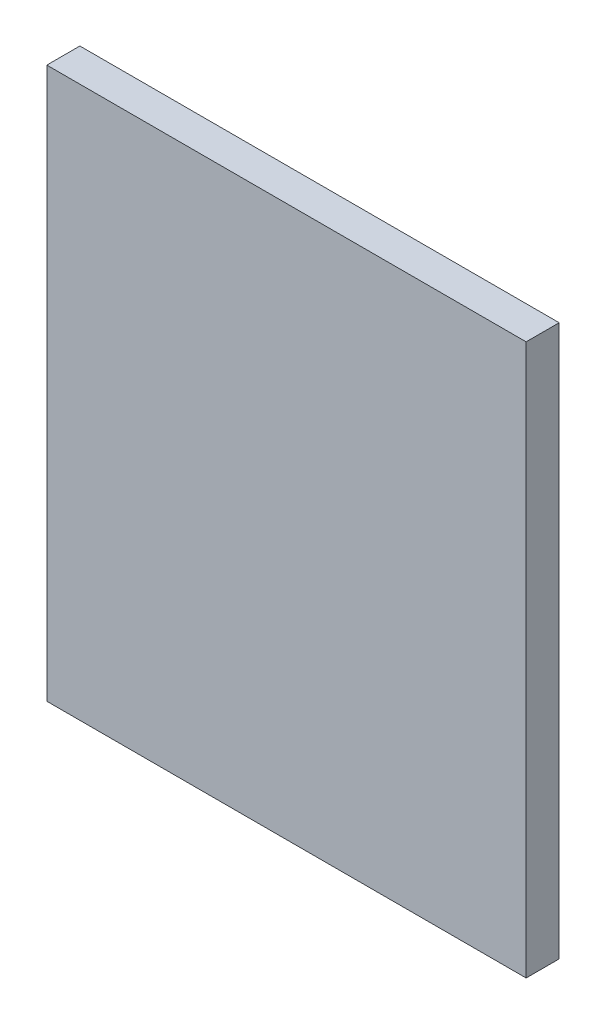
ISO-10303-21;
HEADER;
FILE_DESCRIPTION(('STEP AP214'),'2;1');
FILE_NAME('part.step','',(''),(''),'','','');
FILE_SCHEMA(('AUTOMOTIVE_DESIGN { 1 0 10303 214 1 1 1 1 }'));
ENDSEC;
DATA;
#1=APPLICATION_CONTEXT('core data for automotive mechanical design processes');
#2=APPLICATION_PROTOCOL_DEFINITION('international standard','automotive_design',2000,#1);
#3=PRODUCT_CONTEXT('',#1,'mechanical');
#4=PRODUCT('Part','Part','',(#3));
#5=PRODUCT_RELATED_PRODUCT_CATEGORY('part','',(#4));
#6=PRODUCT_DEFINITION_FORMATION('','',#4);
#7=PRODUCT_DEFINITION_CONTEXT('part definition',#1,'design');
#8=PRODUCT_DEFINITION('design','',#6,#7);
#9=PRODUCT_DEFINITION_SHAPE('','',#8);
#10=(LENGTH_UNIT() NAMED_UNIT(*) SI_UNIT(.MILLI.,.METRE.));
#11=(NAMED_UNIT(*) PLANE_ANGLE_UNIT() SI_UNIT($,.RADIAN.));
#12=(NAMED_UNIT(*) SI_UNIT($,.STERADIAN.) SOLID_ANGLE_UNIT());
#13=UNCERTAINTY_MEASURE_WITH_UNIT(LENGTH_MEASURE(1.E-05),#10,'distance_accuracy_value','');
#14=(GEOMETRIC_REPRESENTATION_CONTEXT(3) GLOBAL_UNCERTAINTY_ASSIGNED_CONTEXT((#13)) GLOBAL_UNIT_ASSIGNED_CONTEXT((#10,
#11,#12)) REPRESENTATION_CONTEXT('',''));
#15=CARTESIAN_POINT('',(0.,0.,0.));
#16=DIRECTION('',(0.,0.,1.));
#17=DIRECTION('',(1.,0.,0.));
#18=AXIS2_PLACEMENT_3D('',#15,#16,#17);
#19=CARTESIAN_POINT('',(0.,0.,12.));
#20=DIRECTION('',(0.,0.,1.));
#21=DIRECTION('',(1.,0.,0.));
#22=AXIS2_PLACEMENT_3D('',#19,#20,#21);
#23=PLANE('',#22);
#24=DIRECTION('',(1.,0.,0.));
#25=VECTOR('',#24,1.);
#26=CARTESIAN_POINT('',(-87.,-100.,12.));
#27=LINE('',#26,#25);
#28=CARTESIAN_POINT('',(-87.,-100.,12.));
#29=VERTEX_POINT('',#28);
#30=CARTESIAN_POINT('',(87.,-100.,12.));
#31=VERTEX_POINT('',#30);
#32=EDGE_CURVE('E81',#29,#31,#27,.T.);
#33=ORIENTED_EDGE('',*,*,#32,.T.);
#34=DIRECTION('',(0.,1.,0.));
#35=VECTOR('',#34,1.);
#36=CARTESIAN_POINT('',(87.,-100.,12.));
#37=LINE('',#36,#35);
#38=CARTESIAN_POINT('',(87.,100.,12.));
#39=VERTEX_POINT('',#38);
#40=EDGE_CURVE('E104',#31,#39,#37,.T.);
#41=ORIENTED_EDGE('',*,*,#40,.T.);
#42=DIRECTION('',(-1.,0.,0.));
#43=VECTOR('',#42,1.);
#44=CARTESIAN_POINT('',(87.,100.,12.));
#45=LINE('',#44,#43);
#46=CARTESIAN_POINT('',(-87.,100.,12.));
#47=VERTEX_POINT('',#46);
#48=EDGE_CURVE('E73',#39,#47,#45,.T.);
#49=ORIENTED_EDGE('',*,*,#48,.T.);
#50=DIRECTION('',(0.,-1.,0.));
#51=VECTOR('',#50,1.);
#52=CARTESIAN_POINT('',(-87.,100.,12.));
#53=LINE('',#52,#51);
#54=EDGE_CURVE('E10',#47,#29,#53,.T.);
#55=ORIENTED_EDGE('',*,*,#54,.T.);
#56=EDGE_LOOP('',(#33,#41,#49,#55));
#57=FACE_BOUND('',#56,.T.);
#58=ADVANCED_FACE('F16',(#57),#23,.T.);
#59=CARTESIAN_POINT('',(0.,0.,0.));
#60=DIRECTION('',(0.,0.,1.));
#61=DIRECTION('',(1.,0.,0.));
#62=AXIS2_PLACEMENT_3D('',#59,#60,#61);
#63=PLANE('',#62);
#64=DIRECTION('',(0.,-1.,0.));
#65=VECTOR('',#64,1.);
#66=CARTESIAN_POINT('',(-87.,100.,0.));
#67=LINE('',#66,#65);
#68=CARTESIAN_POINT('',(-87.,100.,0.));
#69=VERTEX_POINT('',#68);
#70=CARTESIAN_POINT('',(-87.,-100.,0.));
#71=VERTEX_POINT('',#70);
#72=EDGE_CURVE('E24',#69,#71,#67,.T.);
#73=ORIENTED_EDGE('',*,*,#72,.F.);
#74=DIRECTION('',(-1.,0.,0.));
#75=VECTOR('',#74,1.);
#76=CARTESIAN_POINT('',(87.,100.,0.));
#77=LINE('',#76,#75);
#78=CARTESIAN_POINT('',(87.,100.,0.));
#79=VERTEX_POINT('',#78);
#80=EDGE_CURVE('E108',#79,#69,#77,.T.);
#81=ORIENTED_EDGE('',*,*,#80,.F.);
#82=DIRECTION('',(0.,1.,0.));
#83=VECTOR('',#82,1.);
#84=CARTESIAN_POINT('',(87.,-100.,0.));
#85=LINE('',#84,#83);
#86=CARTESIAN_POINT('',(87.,-100.,0.));
#87=VERTEX_POINT('',#86);
#88=EDGE_CURVE('E83',#87,#79,#85,.T.);
#89=ORIENTED_EDGE('',*,*,#88,.F.);
#90=DIRECTION('',(1.,0.,0.));
#91=VECTOR('',#90,1.);
#92=CARTESIAN_POINT('',(-87.,-100.,0.));
#93=LINE('',#92,#91);
#94=EDGE_CURVE('E79',#71,#87,#93,.T.);
#95=ORIENTED_EDGE('',*,*,#94,.F.);
#96=EDGE_LOOP('',(#73,#81,#89,#95));
#97=FACE_BOUND('',#96,.T.);
#98=ADVANCED_FACE('F85',(#97),#63,.F.);
#99=CARTESIAN_POINT('',(-87.,100.,0.));
#100=DIRECTION('',(1.,0.,0.));
#101=DIRECTION('',(0.,1.,0.));
#102=AXIS2_PLACEMENT_3D('',#99,#100,#101);
#103=PLANE('',#102);
#104=ORIENTED_EDGE('',*,*,#72,.T.);
#105=DIRECTION('',(0.,0.,1.));
#106=VECTOR('',#105,1.);
#107=CARTESIAN_POINT('',(-87.,-100.,0.));
#108=LINE('',#107,#106);
#109=EDGE_CURVE('E67',#71,#29,#108,.T.);
#110=ORIENTED_EDGE('',*,*,#109,.T.);
#111=ORIENTED_EDGE('',*,*,#54,.F.);
#112=DIRECTION('',(0.,0.,1.));
#113=VECTOR('',#112,1.);
#114=CARTESIAN_POINT('',(-87.,100.,0.));
#115=LINE('',#114,#113);
#116=EDGE_CURVE('E70',#69,#47,#115,.T.);
#117=ORIENTED_EDGE('',*,*,#116,.F.);
#118=EDGE_LOOP('',(#104,#110,#111,#117));
#119=FACE_BOUND('',#118,.T.);
#120=ADVANCED_FACE('F66',(#119),#103,.F.);
#121=CARTESIAN_POINT('',(87.,100.,0.));
#122=DIRECTION('',(0.,-1.,0.));
#123=DIRECTION('',(0.,0.,-1.));
#124=AXIS2_PLACEMENT_3D('',#121,#122,#123);
#125=PLANE('',#124);
#126=ORIENTED_EDGE('',*,*,#80,.T.);
#127=ORIENTED_EDGE('',*,*,#116,.T.);
#128=ORIENTED_EDGE('',*,*,#48,.F.);
#129=DIRECTION('',(0.,0.,1.));
#130=VECTOR('',#129,1.);
#131=CARTESIAN_POINT('',(87.,100.,0.));
#132=LINE('',#131,#130);
#133=EDGE_CURVE('E103',#79,#39,#132,.T.);
#134=ORIENTED_EDGE('',*,*,#133,.F.);
#135=EDGE_LOOP('',(#126,#127,#128,#134));
#136=FACE_BOUND('',#135,.T.);
#137=ADVANCED_FACE('F116',(#136),#125,.F.);
#138=CARTESIAN_POINT('',(87.,-100.,0.));
#139=DIRECTION('',(-1.,0.,0.));
#140=DIRECTION('',(0.,0.,1.));
#141=AXIS2_PLACEMENT_3D('',#138,#139,#140);
#142=PLANE('',#141);
#143=ORIENTED_EDGE('',*,*,#88,.T.);
#144=ORIENTED_EDGE('',*,*,#133,.T.);
#145=ORIENTED_EDGE('',*,*,#40,.F.);
#146=DIRECTION('',(0.,0.,1.));
#147=VECTOR('',#146,1.);
#148=CARTESIAN_POINT('',(87.,-100.,0.));
#149=LINE('',#148,#147);
#150=EDGE_CURVE('E89',#87,#31,#149,.T.);
#151=ORIENTED_EDGE('',*,*,#150,.F.);
#152=EDGE_LOOP('',(#143,#144,#145,#151));
#153=FACE_BOUND('',#152,.T.);
#154=ADVANCED_FACE('F119',(#153),#142,.F.);
#155=CARTESIAN_POINT('',(-87.,-100.,0.));
#156=DIRECTION('',(0.,1.,0.));
#157=DIRECTION('',(1.,0.,0.));
#158=AXIS2_PLACEMENT_3D('',#155,#156,#157);
#159=PLANE('',#158);
#160=ORIENTED_EDGE('',*,*,#94,.T.);
#161=ORIENTED_EDGE('',*,*,#150,.T.);
#162=ORIENTED_EDGE('',*,*,#32,.F.);
#163=ORIENTED_EDGE('',*,*,#109,.F.);
#164=EDGE_LOOP('',(#160,#161,#162,#163));
#165=FACE_BOUND('',#164,.T.);
#166=ADVANCED_FACE('F77',(#165),#159,.F.);
#167=CLOSED_SHELL('',(#58,#98,#120,#137,#154,#166));
#168=MANIFOLD_SOLID_BREP('B1',#167);
#169=ADVANCED_BREP_SHAPE_REPRESENTATION('',(#18,#168),#14);
#170=SHAPE_DEFINITION_REPRESENTATION(#9,#169);
ENDSEC;
END-ISO-10303-21;
